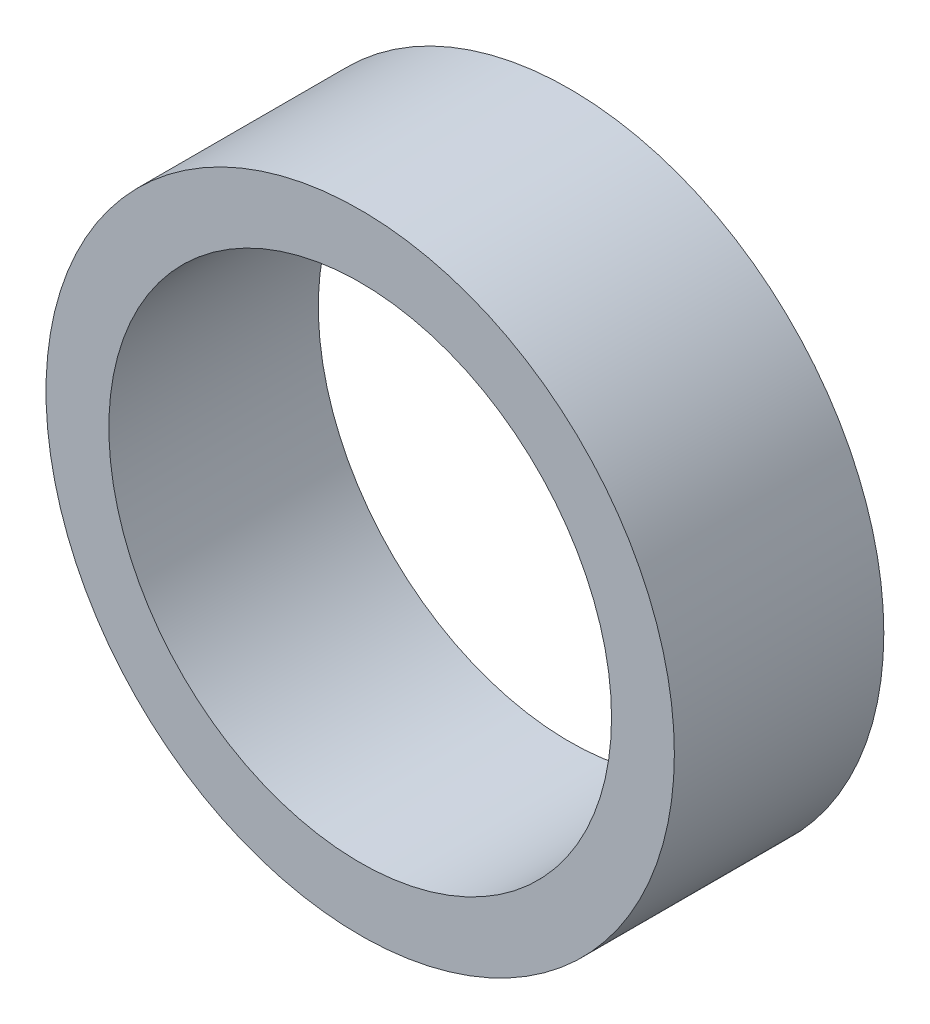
ISO-10303-21;
HEADER;
FILE_DESCRIPTION(('STEP AP214'),'2;1');
FILE_NAME('part.step','',(''),(''),'','','');
FILE_SCHEMA(('AUTOMOTIVE_DESIGN { 1 0 10303 214 1 1 1 1 }'));
ENDSEC;
DATA;
#1=APPLICATION_CONTEXT('core data for automotive mechanical design processes');
#2=APPLICATION_PROTOCOL_DEFINITION('international standard','automotive_design',2000,#1);
#3=PRODUCT_CONTEXT('',#1,'mechanical');
#4=PRODUCT('Part','Part','',(#3));
#5=PRODUCT_RELATED_PRODUCT_CATEGORY('part','',(#4));
#6=PRODUCT_DEFINITION_FORMATION('','',#4);
#7=PRODUCT_DEFINITION_CONTEXT('part definition',#1,'design');
#8=PRODUCT_DEFINITION('design','',#6,#7);
#9=PRODUCT_DEFINITION_SHAPE('','',#8);
#10=(LENGTH_UNIT() NAMED_UNIT(*) SI_UNIT(.MILLI.,.METRE.));
#11=(NAMED_UNIT(*) PLANE_ANGLE_UNIT() SI_UNIT($,.RADIAN.));
#12=(NAMED_UNIT(*) SI_UNIT($,.STERADIAN.) SOLID_ANGLE_UNIT());
#13=UNCERTAINTY_MEASURE_WITH_UNIT(LENGTH_MEASURE(1.E-05),#10,'distance_accuracy_value','');
#14=(GEOMETRIC_REPRESENTATION_CONTEXT(3) GLOBAL_UNCERTAINTY_ASSIGNED_CONTEXT((#13)) GLOBAL_UNIT_ASSIGNED_CONTEXT((#10,
#11,#12)) REPRESENTATION_CONTEXT('',''));
#15=CARTESIAN_POINT('',(0.,0.,0.));
#16=DIRECTION('',(0.,0.,1.));
#17=DIRECTION('',(1.,0.,0.));
#18=AXIS2_PLACEMENT_3D('',#15,#16,#17);
#19=CARTESIAN_POINT('',(0.,0.,5.));
#20=DIRECTION('',(0.,0.,-1.));
#21=DIRECTION('',(0.,1.,0.));
#22=AXIS2_PLACEMENT_3D('',#19,#20,#21);
#23=CYLINDRICAL_SURFACE('',#22,6.);
#24=CARTESIAN_POINT('',(0.,0.,5.));
#25=DIRECTION('',(0.,0.,-1.));
#26=DIRECTION('',(1.,0.,0.));
#27=AXIS2_PLACEMENT_3D('',#24,#25,#26);
#28=CIRCLE('',#27,6.);
#29=CARTESIAN_POINT('',(6.,0.,5.));
#30=VERTEX_POINT('',#29);
#31=EDGE_CURVE('E8',#30,#30,#28,.T.);
#32=ORIENTED_EDGE('',*,*,#31,.F.);
#33=EDGE_LOOP('',(#32));
#34=FACE_BOUND('',#33,.T.);
#35=CARTESIAN_POINT('',(0.,0.,0.));
#36=DIRECTION('',(0.,0.,-1.));
#37=DIRECTION('',(1.,0.,0.));
#38=AXIS2_PLACEMENT_3D('',#35,#36,#37);
#39=CIRCLE('',#38,6.);
#40=CARTESIAN_POINT('',(6.,0.,0.));
#41=VERTEX_POINT('',#40);
#42=EDGE_CURVE('E23',#41,#41,#39,.T.);
#43=ORIENTED_EDGE('',*,*,#42,.T.);
#44=EDGE_LOOP('',(#43));
#45=FACE_BOUND('',#44,.T.);
#46=ADVANCED_FACE('F12',(#34,#45),#23,.F.);
#47=CARTESIAN_POINT('',(0.,0.,5.));
#48=DIRECTION('',(0.,0.,-1.));
#49=DIRECTION('',(0.,1.,0.));
#50=AXIS2_PLACEMENT_3D('',#47,#48,#49);
#51=CYLINDRICAL_SURFACE('',#50,7.5);
#52=CARTESIAN_POINT('',(0.,0.,5.));
#53=DIRECTION('',(0.,0.,-1.));
#54=DIRECTION('',(1.,0.,0.));
#55=AXIS2_PLACEMENT_3D('',#52,#53,#54);
#56=CIRCLE('',#55,7.5);
#57=CARTESIAN_POINT('',(7.5,0.,5.));
#58=VERTEX_POINT('',#57);
#59=EDGE_CURVE('E19',#58,#58,#56,.T.);
#60=ORIENTED_EDGE('',*,*,#59,.T.);
#61=EDGE_LOOP('',(#60));
#62=FACE_BOUND('',#61,.T.);
#63=CARTESIAN_POINT('',(0.,0.,0.));
#64=DIRECTION('',(0.,0.,-1.));
#65=DIRECTION('',(1.,0.,0.));
#66=AXIS2_PLACEMENT_3D('',#63,#64,#65);
#67=CIRCLE('',#66,7.5);
#68=CARTESIAN_POINT('',(7.5,0.,0.));
#69=VERTEX_POINT('',#68);
#70=EDGE_CURVE('E28',#69,#69,#67,.T.);
#71=ORIENTED_EDGE('',*,*,#70,.F.);
#72=EDGE_LOOP('',(#71));
#73=FACE_BOUND('',#72,.T.);
#74=ADVANCED_FACE('F14',(#62,#73),#51,.T.);
#75=CARTESIAN_POINT('',(0.,0.,5.));
#76=DIRECTION('',(0.,0.,-1.));
#77=DIRECTION('',(0.,1.,0.));
#78=AXIS2_PLACEMENT_3D('',#75,#76,#77);
#79=PLANE('',#78);
#80=ORIENTED_EDGE('',*,*,#31,.T.);
#81=EDGE_LOOP('',(#80));
#82=FACE_BOUND('',#81,.T.);
#83=ORIENTED_EDGE('',*,*,#59,.F.);
#84=EDGE_LOOP('',(#83));
#85=FACE_BOUND('',#84,.T.);
#86=ADVANCED_FACE('F40',(#82,#85),#79,.F.);
#87=CARTESIAN_POINT('',(0.,0.,0.));
#88=DIRECTION('',(0.,0.,-1.));
#89=DIRECTION('',(0.,1.,0.));
#90=AXIS2_PLACEMENT_3D('',#87,#88,#89);
#91=PLANE('',#90);
#92=ORIENTED_EDGE('',*,*,#42,.F.);
#93=EDGE_LOOP('',(#92));
#94=FACE_BOUND('',#93,.T.);
#95=ORIENTED_EDGE('',*,*,#70,.T.);
#96=EDGE_LOOP('',(#95));
#97=FACE_BOUND('',#96,.T.);
#98=ADVANCED_FACE('F37',(#94,#97),#91,.T.);
#99=CLOSED_SHELL('',(#46,#74,#86,#98));
#100=MANIFOLD_SOLID_BREP('B1',#99);
#101=ADVANCED_BREP_SHAPE_REPRESENTATION('',(#18,#100),#14);
#102=SHAPE_DEFINITION_REPRESENTATION(#9,#101);
ENDSEC;
END-ISO-10303-21;
